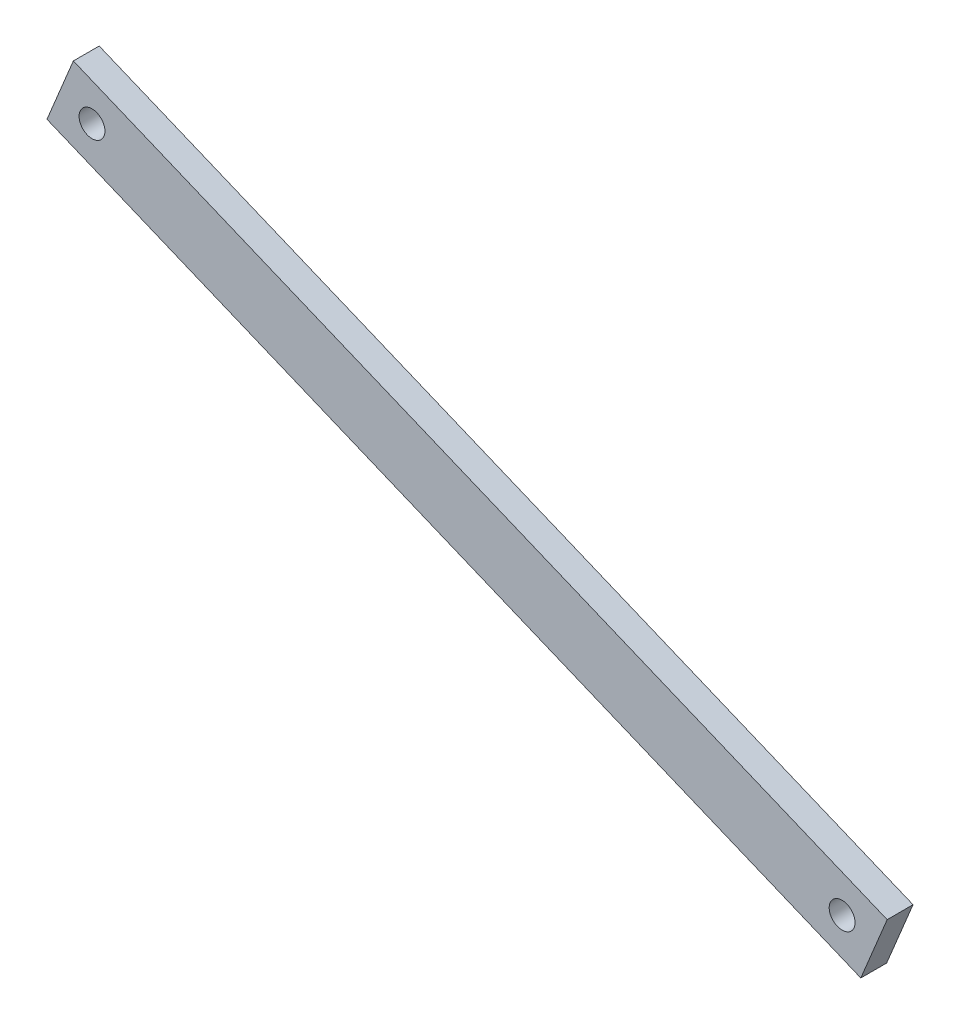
from build123d import *

# Parameters (mm, degrees)
ESQUISSE1_R      = 1.5
EXTRUSION1_DEPTH = 3


with BuildPart() as part:
    # Esquisse1 → Extrusion1 (new body)
    with BuildSketch(Plane.XY):
        Polygon((92.225474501, 2.166660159), (-2.166660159, 41.225474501), (-5.225474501, 33.833339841), (89.166660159, -5.225474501), align=None)
        with Locations((87, 0)):
            Circle(ESQUISSE1_R, mode=Mode.SUBTRACT)
        with Locations((0, 36)):
            Circle(ESQUISSE1_R, mode=Mode.SUBTRACT)
    extrude(amount=EXTRUSION1_DEPTH)


solid = part.part
